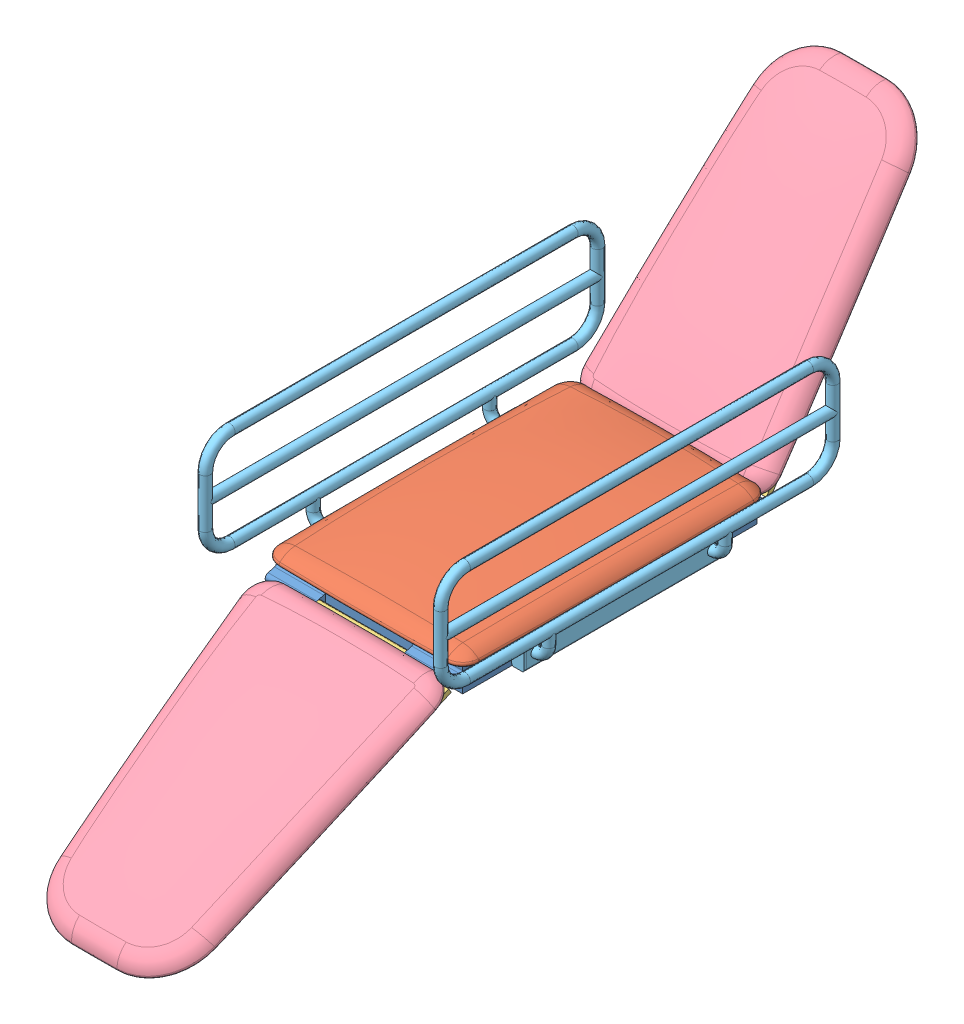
SolidWorks assembly Couch.sldasm, configuration Default (file format 11000). Lengths in mm.
Overall size (501.34 840.98 1615.3).
11 component instances, 5 part files, 10 mates.
Components (placement in the parent):
- Middle-1: Middle.sldasm [Default] at origin size (416.79 91.39 646)
  - Couch_center-1: Couch_center.SLDPRT [Default] at origin size (380 50 646)
  - Middle_pad-1: Middle_pad.sldprt [Default] at (0 10 0) x (-1 0 0) z (0 1 0) size (416.79 638.66 41.46)
- End-1: End.sldasm [Default] at (0 -8.6384 -326.8651) x (0 -0.766044 0.642788) z (-1 0 0) size (638.53 63.65 399.28)
  - Couch_end-1: Couch_end.SLDPRT [Default] at origin size (620.5 16 380)
  - End_pad-1: End_pad.sldprt [Default] at (0 10 0) x (-1 0 0) z (0 1 0) size (634.2 399.28 50.88)
- End-2: End.sldasm [Default] at (0 -25.5801 323.3253) x (0 0.5 -0.866025) z (1 0 0) size (638.53 63.65 399.28)
  - Couch_end-1: Couch_end.SLDPRT [Default] at origin size (620.5 16 380)
  - End_pad-1: End_pad.sldprt [Default] at (0 10 0) x (-1 0 0) z (0 1 0) size (634.2 399.28 50.88)
- side_rail-1: side_rail.SLDPRT [Default<As Machined>] at (-190 -15 -5) x (0 0 1) z (-1 0 0) size (821.34 285.67 60.67)
- side_rail-2: side_rail.SLDPRT [Default<As Machined>] at (190 -15 -5) x (0 0 -1) z (1 0 0) size (821.34 285.67 60.67)
Mates (geometry in assembly coordinates):
- Coincident20: coincident: circle of assembly; circle of assembly; circle of Middle-1/Couch_center-1; circle of End-1/Couch_end-1
- Coincident21: coincident: circle of assembly; circle of assembly; circle of Middle-1/Couch_center-1; circle of End-2/Couch_end-1
- Angle4: planar angle = 0.872665 rad: plane of assembly; plane of assembly; plane of Middle-1/Couch_center-1 through (190 -40 -300) normal (0 -1 0); plane of End-1/Couch_end-1 through (45.8737 374.3838 -648.2589) normal (0 -0.642788 -0.766044)
- Angle5: planar angle = 0.523599 rad: plane of assembly; plane of assembly; plane of Middle-1/Couch_center-1 through (190 -40 -300) normal (0 -1 0); plane of End-2/Couch_end-1 through (-45.8737 -275.5801 756.338) normal (0 -0.866025 -0.5)
- Coincident221: coincident: plane of assembly; plane of assembly; plane of Middle-1/Couch_center-1 through (190 10 -300) normal (1 0 0); plane of side_rail-2 through (190 6 -205) normal (-1 0 0)
- Coincident23: coincident: plane of assembly; plane of assembly; plane of Middle-1/Couch_center-1 through (-190 10 -300) normal (-1 0 0); plane of side_rail-1 through (-190 6 195) normal (1 0 0)
- Coincident24: coincident: plane of assembly; plane of assembly; plane of side_rail-1 through (-211 -36 200) normal (0 0 1); plane of side_rail-2 through (211 -36 200) normal (0 0 1)
- Coincident25: coincident: plane of assembly; plane of assembly; plane of Middle-1/Couch_center-1 through (190 -40 -300) normal (0 -1 0); plane of side_rail-1 through (-211 -40 195) normal (0 -1 0)
- Distance1: distance = 100 mm: plane of assembly; plane of assembly; plane of side_rail-1 through (-211 -36 200) normal (0 0 1); plane of Middle-1/Couch_center-1 through (-190 10 300) normal (0 0 1)
- Coincident27: coincident: plane of assembly; plane of assembly; plane of side_rail-1 through (-211 -40 195) normal (0 -1 0); plane of side_rail-2 through (211 -40 -205) normal (0 -1 0)
